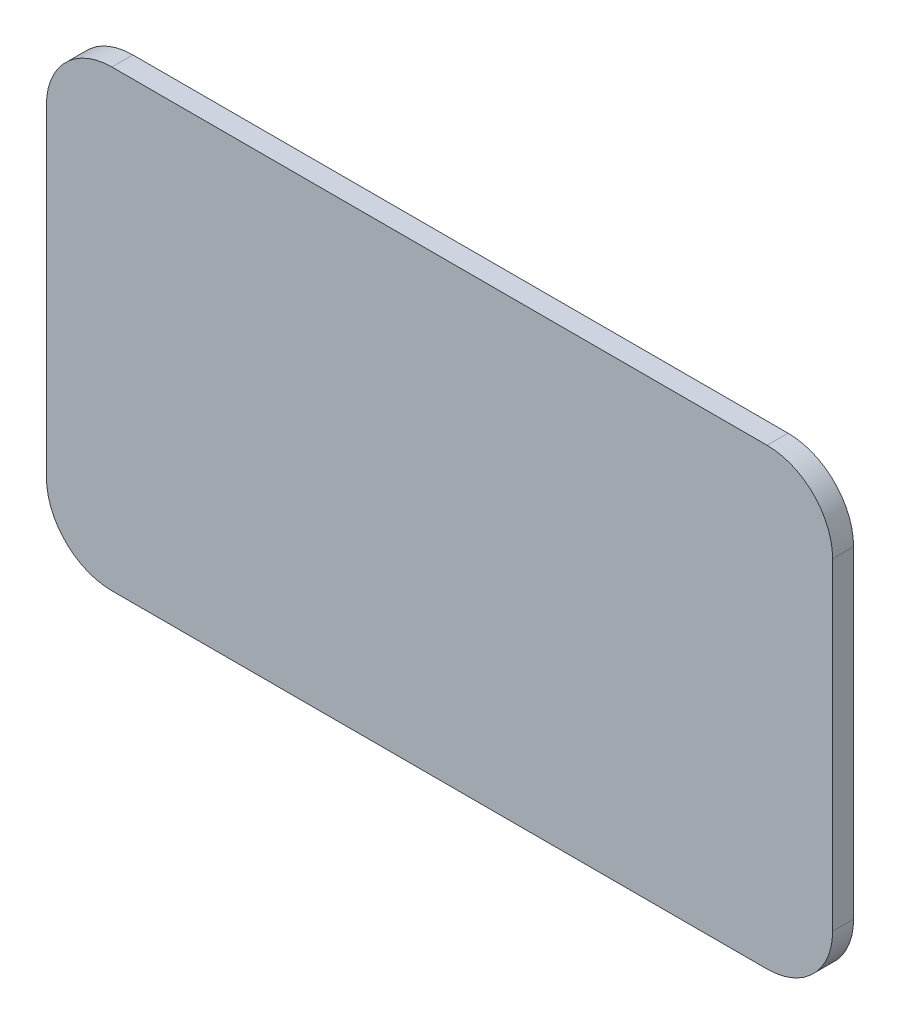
from build123d import *

# Parameters (mm, degrees)
UNDRILLED_ORIGINAL_OUTLINE_DEPTH = 1.6


with BuildPart() as part:
    # Sketch 1 → Undrilled_original_outline (new body)
    with BuildSketch(Plane.XY):
        with BuildLine():
            Line((-20.273, -10.12800108), (29.72699938, -10.12800108))
            ThreePointArc((29.72699938, -10.12800108), (33.262533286, -8.663534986), (34.72699938, -5.12800108))
            Line((34.72699938, -5.12800108), (34.72699938, 19.49100004))
            ThreePointArc((34.72699938, 19.49100004), (33.262533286, 23.026533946), (29.72699938, 24.49100004))
            Line((29.72699938, 24.49100004), (-20.273, 24.49100004))
            ThreePointArc((-20.273, 24.49100004), (-23.808533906, 23.026533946), (-25.273, 19.49100004))
            Line((-25.273, 19.49100004), (-25.273, -5.12800108))
            ThreePointArc((-25.273, -5.12800108), (-23.808533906, -8.663534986), (-20.273, -10.12800108))
        make_face()
    extrude(amount=UNDRILLED_ORIGINAL_OUTLINE_DEPTH)


solid = part.part
